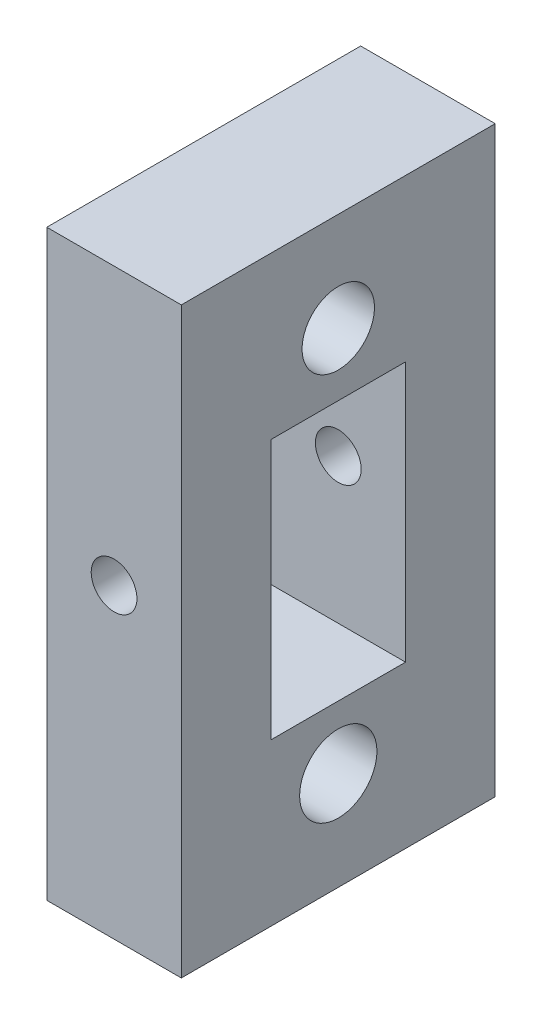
ISO-10303-21;
HEADER;
FILE_DESCRIPTION(('STEP AP214'),'2;1');
FILE_NAME('part.step','',(''),(''),'','','');
FILE_SCHEMA(('AUTOMOTIVE_DESIGN { 1 0 10303 214 1 1 1 1 }'));
ENDSEC;
DATA;
#1=APPLICATION_CONTEXT('core data for automotive mechanical design processes');
#2=APPLICATION_PROTOCOL_DEFINITION('international standard','automotive_design',2000,#1);
#3=PRODUCT_CONTEXT('',#1,'mechanical');
#4=PRODUCT('Part','Part','',(#3));
#5=PRODUCT_RELATED_PRODUCT_CATEGORY('part','',(#4));
#6=PRODUCT_DEFINITION_FORMATION('','',#4);
#7=PRODUCT_DEFINITION_CONTEXT('part definition',#1,'design');
#8=PRODUCT_DEFINITION('design','',#6,#7);
#9=PRODUCT_DEFINITION_SHAPE('','',#8);
#10=(LENGTH_UNIT() NAMED_UNIT(*) SI_UNIT(.MILLI.,.METRE.));
#11=(NAMED_UNIT(*) PLANE_ANGLE_UNIT() SI_UNIT($,.RADIAN.));
#12=(NAMED_UNIT(*) SI_UNIT($,.STERADIAN.) SOLID_ANGLE_UNIT());
#13=UNCERTAINTY_MEASURE_WITH_UNIT(LENGTH_MEASURE(1.E-05),#10,'distance_accuracy_value','');
#14=(GEOMETRIC_REPRESENTATION_CONTEXT(3) GLOBAL_UNCERTAINTY_ASSIGNED_CONTEXT((#13)) GLOBAL_UNIT_ASSIGNED_CONTEXT((#10,
#11,#12)) REPRESENTATION_CONTEXT('',''));
#15=CARTESIAN_POINT('',(0.,0.,0.));
#16=DIRECTION('',(0.,0.,1.));
#17=DIRECTION('',(1.,0.,0.));
#18=AXIS2_PLACEMENT_3D('',#15,#16,#17);
#19=CARTESIAN_POINT('',(0.,0.,0.));
#20=DIRECTION('',(0.,0.,1.));
#21=DIRECTION('',(1.,0.,0.));
#22=AXIS2_PLACEMENT_3D('',#19,#20,#21);
#23=PLANE('',#22);
#24=DIRECTION('',(1.,0.,0.));
#25=VECTOR('',#24,1.);
#26=CARTESIAN_POINT('',(-52.6212681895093,-16.1567681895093,0.));
#27=LINE('',#26,#25);
#28=CARTESIAN_POINT('',(-67.6212681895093,-16.1567681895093,0.));
#29=VERTEX_POINT('',#28);
#30=CARTESIAN_POINT('',(-52.6212681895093,-16.1567681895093,0.));
#31=VERTEX_POINT('',#30);
#32=EDGE_CURVE('E134',#29,#31,#27,.T.);
#33=ORIENTED_EDGE('',*,*,#32,.F.);
#34=DIRECTION('',(0.,-1.,0.));
#35=VECTOR('',#34,1.);
#36=CARTESIAN_POINT('',(-67.6212681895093,30.8432318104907,0.));
#37=LINE('',#36,#35);
#38=CARTESIAN_POINT('',(-67.6212681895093,12.8432318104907,0.));
#39=VERTEX_POINT('',#38);
#40=EDGE_CURVE('E157',#39,#29,#37,.T.);
#41=ORIENTED_EDGE('',*,*,#40,.F.);
#42=DIRECTION('',(-1.,0.,0.));
#43=VECTOR('',#42,1.);
#44=CARTESIAN_POINT('',(-52.6212681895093,12.8432318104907,0.));
#45=LINE('',#44,#43);
#46=CARTESIAN_POINT('',(-52.6212681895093,12.8432318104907,0.));
#47=VERTEX_POINT('',#46);
#48=EDGE_CURVE('E144',#47,#39,#45,.T.);
#49=ORIENTED_EDGE('',*,*,#48,.F.);
#50=DIRECTION('',(0.,1.,0.));
#51=VECTOR('',#50,1.);
#52=CARTESIAN_POINT('',(-52.6212681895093,30.8432318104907,0.));
#53=LINE('',#52,#51);
#54=EDGE_CURVE('E55',#31,#47,#53,.T.);
#55=ORIENTED_EDGE('',*,*,#54,.F.);
#56=EDGE_LOOP('',(#33,#41,#49,#55));
#57=FACE_BOUND('',#56,.T.);
#58=CARTESIAN_POINT('',(-60.1212681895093,0.,0.));
#59=DIRECTION('',(0.,0.,1.));
#60=DIRECTION('',(1.,0.,0.));
#61=AXIS2_PLACEMENT_3D('',#58,#59,#60);
#62=CIRCLE('',#61,2.54999999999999);
#63=CARTESIAN_POINT('',(-57.5712681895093,0.,0.));
#64=VERTEX_POINT('',#63);
#65=EDGE_CURVE('E252',#64,#64,#62,.F.);
#66=ORIENTED_EDGE('',*,*,#65,.F.);
#67=EDGE_LOOP('',(#66));
#68=FACE_BOUND('',#67,.T.);
#69=ADVANCED_FACE('F33',(#57,#68),#23,.F.);
#70=CARTESIAN_POINT('',(0.,0.,10.));
#71=DIRECTION('',(0.,0.,1.));
#72=DIRECTION('',(1.,0.,0.));
#73=AXIS2_PLACEMENT_3D('',#70,#71,#72);
#74=PLANE('',#73);
#75=DIRECTION('',(0.,-1.,0.));
#76=VECTOR('',#75,1.);
#77=CARTESIAN_POINT('',(-67.6212681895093,30.8432318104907,10.));
#78=LINE('',#77,#76);
#79=CARTESIAN_POINT('',(-67.6212681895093,30.8432318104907,10.));
#80=VERTEX_POINT('',#79);
#81=CARTESIAN_POINT('',(-67.6212681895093,-34.1567681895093,10.));
#82=VERTEX_POINT('',#81);
#83=EDGE_CURVE('E151',#80,#82,#78,.T.);
#84=ORIENTED_EDGE('',*,*,#83,.T.);
#85=DIRECTION('',(1.,0.,0.));
#86=VECTOR('',#85,1.);
#87=CARTESIAN_POINT('',(-67.6212681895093,-34.1567681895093,10.));
#88=LINE('',#87,#86);
#89=CARTESIAN_POINT('',(-52.6212681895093,-34.1567681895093,10.));
#90=VERTEX_POINT('',#89);
#91=EDGE_CURVE('E183',#82,#90,#88,.T.);
#92=ORIENTED_EDGE('',*,*,#91,.T.);
#93=DIRECTION('',(0.,1.,0.));
#94=VECTOR('',#93,1.);
#95=CARTESIAN_POINT('',(-52.6212681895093,30.8432318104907,10.));
#96=LINE('',#95,#94);
#97=CARTESIAN_POINT('',(-52.6212681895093,30.8432318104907,10.));
#98=VERTEX_POINT('',#97);
#99=EDGE_CURVE('E105',#90,#98,#96,.T.);
#100=ORIENTED_EDGE('',*,*,#99,.T.);
#101=DIRECTION('',(-1.,0.,0.));
#102=VECTOR('',#101,1.);
#103=CARTESIAN_POINT('',(-67.6212681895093,30.8432318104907,10.));
#104=LINE('',#103,#102);
#105=EDGE_CURVE('E175',#98,#80,#104,.T.);
#106=ORIENTED_EDGE('',*,*,#105,.T.);
#107=EDGE_LOOP('',(#84,#92,#100,#106));
#108=FACE_BOUND('',#107,.T.);
#109=CARTESIAN_POINT('',(-60.1212681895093,0.,10.));
#110=DIRECTION('',(0.,0.,-1.));
#111=DIRECTION('',(-1.,0.,0.));
#112=AXIS2_PLACEMENT_3D('',#109,#110,#111);
#113=CIRCLE('',#112,2.54999999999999);
#114=CARTESIAN_POINT('',(-62.6712681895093,0.,10.));
#115=VERTEX_POINT('',#114);
#116=EDGE_CURVE('E249',#115,#115,#113,.T.);
#117=ORIENTED_EDGE('',*,*,#116,.T.);
#118=EDGE_LOOP('',(#117));
#119=FACE_BOUND('',#118,.T.);
#120=ADVANCED_FACE('F185',(#108,#119),#74,.T.);
#121=CARTESIAN_POINT('',(0.,0.,-15.));
#122=DIRECTION('',(0.,0.,-1.));
#123=DIRECTION('',(-1.,0.,0.));
#124=AXIS2_PLACEMENT_3D('',#121,#122,#123);
#125=PLANE('',#124);
#126=DIRECTION('',(0.,-1.,0.));
#127=VECTOR('',#126,1.);
#128=CARTESIAN_POINT('',(-52.6212681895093,30.8432318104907,-15.));
#129=LINE('',#128,#127);
#130=CARTESIAN_POINT('',(-52.6212681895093,12.8432318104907,-15.));
#131=VERTEX_POINT('',#130);
#132=CARTESIAN_POINT('',(-52.6212681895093,-16.1567681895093,-15.));
#133=VERTEX_POINT('',#132);
#134=EDGE_CURVE('E126',#131,#133,#129,.T.);
#135=ORIENTED_EDGE('',*,*,#134,.F.);
#136=DIRECTION('',(-1.,0.,0.));
#137=VECTOR('',#136,1.);
#138=CARTESIAN_POINT('',(-52.6212681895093,12.8432318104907,-15.));
#139=LINE('',#138,#137);
#140=CARTESIAN_POINT('',(-67.6212681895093,12.8432318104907,-15.));
#141=VERTEX_POINT('',#140);
#142=EDGE_CURVE('E145',#131,#141,#139,.T.);
#143=ORIENTED_EDGE('',*,*,#142,.T.);
#144=DIRECTION('',(0.,1.,0.));
#145=VECTOR('',#144,1.);
#146=CARTESIAN_POINT('',(-67.6212681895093,30.8432318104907,-15.));
#147=LINE('',#146,#145);
#148=CARTESIAN_POINT('',(-67.6212681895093,-16.1567681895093,-15.));
#149=VERTEX_POINT('',#148);
#150=EDGE_CURVE('E123',#149,#141,#147,.T.);
#151=ORIENTED_EDGE('',*,*,#150,.F.);
#152=DIRECTION('',(1.,0.,0.));
#153=VECTOR('',#152,1.);
#154=CARTESIAN_POINT('',(-52.6212681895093,-16.1567681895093,-15.));
#155=LINE('',#154,#153);
#156=EDGE_CURVE('E137',#149,#133,#155,.T.);
#157=ORIENTED_EDGE('',*,*,#156,.T.);
#158=EDGE_LOOP('',(#135,#143,#151,#157));
#159=FACE_BOUND('',#158,.T.);
#160=CARTESIAN_POINT('',(-60.1212681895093,0.,-15.));
#161=DIRECTION('',(0.,0.,-1.));
#162=DIRECTION('',(-1.,0.,0.));
#163=AXIS2_PLACEMENT_3D('',#160,#161,#162);
#164=CIRCLE('',#163,2.54999999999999);
#165=CARTESIAN_POINT('',(-62.6712681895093,0.,-15.));
#166=VERTEX_POINT('',#165);
#167=EDGE_CURVE('E254',#166,#166,#164,.F.);
#168=ORIENTED_EDGE('',*,*,#167,.F.);
#169=EDGE_LOOP('',(#168));
#170=FACE_BOUND('',#169,.T.);
#171=ADVANCED_FACE('F196',(#159,#170),#125,.F.);
#172=CARTESIAN_POINT('',(0.,0.,-25.));
#173=DIRECTION('',(0.,0.,-1.));
#174=DIRECTION('',(-1.,0.,0.));
#175=AXIS2_PLACEMENT_3D('',#172,#173,#174);
#176=PLANE('',#175);
#177=DIRECTION('',(0.,-1.,0.));
#178=VECTOR('',#177,1.);
#179=CARTESIAN_POINT('',(-52.6212681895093,30.8432318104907,-25.));
#180=LINE('',#179,#178);
#181=CARTESIAN_POINT('',(-52.6212681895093,30.8432318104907,-25.));
#182=VERTEX_POINT('',#181);
#183=CARTESIAN_POINT('',(-52.6212681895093,-34.1567681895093,-25.));
#184=VERTEX_POINT('',#183);
#185=EDGE_CURVE('E104',#182,#184,#180,.T.);
#186=ORIENTED_EDGE('',*,*,#185,.T.);
#187=DIRECTION('',(-1.,0.,0.));
#188=VECTOR('',#187,1.);
#189=CARTESIAN_POINT('',(-52.6212681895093,-34.1567681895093,-25.));
#190=LINE('',#189,#188);
#191=CARTESIAN_POINT('',(-67.6212681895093,-34.1567681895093,-25.));
#192=VERTEX_POINT('',#191);
#193=EDGE_CURVE('E110',#184,#192,#190,.T.);
#194=ORIENTED_EDGE('',*,*,#193,.T.);
#195=DIRECTION('',(0.,1.,0.));
#196=VECTOR('',#195,1.);
#197=CARTESIAN_POINT('',(-67.6212681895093,30.8432318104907,-25.));
#198=LINE('',#197,#196);
#199=CARTESIAN_POINT('',(-67.6212681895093,30.8432318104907,-25.));
#200=VERTEX_POINT('',#199);
#201=EDGE_CURVE('E116',#192,#200,#198,.T.);
#202=ORIENTED_EDGE('',*,*,#201,.T.);
#203=DIRECTION('',(1.,0.,0.));
#204=VECTOR('',#203,1.);
#205=CARTESIAN_POINT('',(-52.6212681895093,30.8432318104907,-25.));
#206=LINE('',#205,#204);
#207=EDGE_CURVE('E122',#200,#182,#206,.T.);
#208=ORIENTED_EDGE('',*,*,#207,.T.);
#209=EDGE_LOOP('',(#186,#194,#202,#208));
#210=FACE_BOUND('',#209,.T.);
#211=CARTESIAN_POINT('',(-60.1212681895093,0.,-25.));
#212=DIRECTION('',(0.,0.,-1.));
#213=DIRECTION('',(-1.,0.,0.));
#214=AXIS2_PLACEMENT_3D('',#211,#212,#213);
#215=CIRCLE('',#214,2.54999999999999);
#216=CARTESIAN_POINT('',(-62.6712681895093,0.,-25.));
#217=VERTEX_POINT('',#216);
#218=EDGE_CURVE('E258',#217,#217,#215,.T.);
#219=ORIENTED_EDGE('',*,*,#218,.F.);
#220=EDGE_LOOP('',(#219));
#221=FACE_BOUND('',#220,.T.);
#222=ADVANCED_FACE('F119',(#210,#221),#176,.T.);
#223=CARTESIAN_POINT('',(-67.6212681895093,30.8432318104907,10.));
#224=DIRECTION('',(1.,0.,0.));
#225=DIRECTION('',(0.,0.,-1.));
#226=AXIS2_PLACEMENT_3D('',#223,#224,#225);
#227=PLANE('',#226);
#228=CARTESIAN_POINT('',(-67.6212681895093,-23.1567681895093,-7.5));
#229=DIRECTION('',(-1.,0.,0.));
#230=DIRECTION('',(0.,0.,1.));
#231=AXIS2_PLACEMENT_3D('',#228,#229,#230);
#232=CIRCLE('',#231,4.30861507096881);
#233=CARTESIAN_POINT('',(-67.6212681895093,-23.1567681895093,-3.19138492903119));
#234=VERTEX_POINT('',#233);
#235=EDGE_CURVE('E253',#234,#234,#232,.T.);
#236=ORIENTED_EDGE('',*,*,#235,.F.);
#237=EDGE_LOOP('',(#236));
#238=FACE_BOUND('',#237,.T.);
#239=CARTESIAN_POINT('',(-67.6212681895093,19.8432318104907,-7.5));
#240=DIRECTION('',(-1.,0.,0.));
#241=DIRECTION('',(0.,0.,1.));
#242=AXIS2_PLACEMENT_3D('',#239,#240,#241);
#243=CIRCLE('',#242,4.03728812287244);
#244=CARTESIAN_POINT('',(-67.6212681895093,19.8432318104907,-3.46271187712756));
#245=VERTEX_POINT('',#244);
#246=EDGE_CURVE('E129',#245,#245,#243,.T.);
#247=ORIENTED_EDGE('',*,*,#246,.F.);
#248=EDGE_LOOP('',(#247));
#249=FACE_BOUND('',#248,.T.);
#250=DIRECTION('',(0.,0.,-1.));
#251=VECTOR('',#250,1.);
#252=CARTESIAN_POINT('',(-67.6212681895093,30.8432318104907,10.));
#253=LINE('',#252,#251);
#254=EDGE_CURVE('E173',#80,#200,#253,.T.);
#255=ORIENTED_EDGE('',*,*,#254,.T.);
#256=ORIENTED_EDGE('',*,*,#201,.F.);
#257=DIRECTION('',(0.,0.,-1.));
#258=VECTOR('',#257,1.);
#259=CARTESIAN_POINT('',(-67.6212681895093,-34.1567681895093,10.));
#260=LINE('',#259,#258);
#261=EDGE_CURVE('E11',#82,#192,#260,.T.);
#262=ORIENTED_EDGE('',*,*,#261,.F.);
#263=ORIENTED_EDGE('',*,*,#83,.F.);
#264=EDGE_LOOP('',(#255,#256,#262,#263));
#265=FACE_BOUND('',#264,.T.);
#266=ORIENTED_EDGE('',*,*,#150,.T.);
#267=DIRECTION('',(0.,0.,1.));
#268=VECTOR('',#267,1.);
#269=CARTESIAN_POINT('',(-67.6212681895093,12.8432318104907,-15.));
#270=LINE('',#269,#268);
#271=EDGE_CURVE('E148',#141,#39,#270,.T.);
#272=ORIENTED_EDGE('',*,*,#271,.T.);
#273=ORIENTED_EDGE('',*,*,#40,.T.);
#274=DIRECTION('',(0.,0.,1.));
#275=VECTOR('',#274,1.);
#276=CARTESIAN_POINT('',(-67.6212681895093,-16.1567681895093,-15.));
#277=LINE('',#276,#275);
#278=EDGE_CURVE('E142',#149,#29,#277,.T.);
#279=ORIENTED_EDGE('',*,*,#278,.F.);
#280=EDGE_LOOP('',(#266,#272,#273,#279));
#281=FACE_BOUND('',#280,.T.);
#282=ADVANCED_FACE('F35',(#238,#249,#265,#281),#227,.F.);
#283=CARTESIAN_POINT('',(-67.6212681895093,-34.1567681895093,10.));
#284=DIRECTION('',(0.,1.,0.));
#285=DIRECTION('',(0.,0.,1.));
#286=AXIS2_PLACEMENT_3D('',#283,#284,#285);
#287=PLANE('',#286);
#288=ORIENTED_EDGE('',*,*,#261,.T.);
#289=ORIENTED_EDGE('',*,*,#193,.F.);
#290=DIRECTION('',(0.,0.,-1.));
#291=VECTOR('',#290,1.);
#292=CARTESIAN_POINT('',(-52.6212681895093,-34.1567681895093,10.));
#293=LINE('',#292,#291);
#294=EDGE_CURVE('E42',#90,#184,#293,.T.);
#295=ORIENTED_EDGE('',*,*,#294,.F.);
#296=ORIENTED_EDGE('',*,*,#91,.F.);
#297=EDGE_LOOP('',(#288,#289,#295,#296));
#298=FACE_BOUND('',#297,.T.);
#299=ADVANCED_FACE('F111',(#298),#287,.F.);
#300=CARTESIAN_POINT('',(-52.6212681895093,30.8432318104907,10.));
#301=DIRECTION('',(-1.,0.,0.));
#302=DIRECTION('',(0.,-1.,0.));
#303=AXIS2_PLACEMENT_3D('',#300,#301,#302);
#304=PLANE('',#303);
#305=CARTESIAN_POINT('',(-52.6212681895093,-23.1567681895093,-7.5));
#306=DIRECTION('',(-1.,0.,0.));
#307=DIRECTION('',(0.,-1.,0.));
#308=AXIS2_PLACEMENT_3D('',#305,#306,#307);
#309=CIRCLE('',#308,4.30861507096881);
#310=CARTESIAN_POINT('',(-52.6212681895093,-27.4653832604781,-7.5));
#311=VERTEX_POINT('',#310);
#312=EDGE_CURVE('E37',#311,#311,#309,.T.);
#313=ORIENTED_EDGE('',*,*,#312,.T.);
#314=EDGE_LOOP('',(#313));
#315=FACE_BOUND('',#314,.T.);
#316=CARTESIAN_POINT('',(-52.6212681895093,19.8432318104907,-7.5));
#317=DIRECTION('',(-1.,0.,0.));
#318=DIRECTION('',(0.,-1.,0.));
#319=AXIS2_PLACEMENT_3D('',#316,#317,#318);
#320=CIRCLE('',#319,4.03728812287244);
#321=CARTESIAN_POINT('',(-52.6212681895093,15.8059436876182,-7.5));
#322=VERTEX_POINT('',#321);
#323=EDGE_CURVE('E135',#322,#322,#320,.T.);
#324=ORIENTED_EDGE('',*,*,#323,.T.);
#325=EDGE_LOOP('',(#324));
#326=FACE_BOUND('',#325,.T.);
#327=DIRECTION('',(0.,0.,1.));
#328=VECTOR('',#327,1.);
#329=CARTESIAN_POINT('',(-52.6212681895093,12.8432318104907,-15.));
#330=LINE('',#329,#328);
#331=EDGE_CURVE('E161',#131,#47,#330,.T.);
#332=ORIENTED_EDGE('',*,*,#331,.F.);
#333=ORIENTED_EDGE('',*,*,#134,.T.);
#334=DIRECTION('',(0.,0.,1.));
#335=VECTOR('',#334,1.);
#336=CARTESIAN_POINT('',(-52.6212681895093,-16.1567681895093,-15.));
#337=LINE('',#336,#335);
#338=EDGE_CURVE('E50',#133,#31,#337,.T.);
#339=ORIENTED_EDGE('',*,*,#338,.T.);
#340=ORIENTED_EDGE('',*,*,#54,.T.);
#341=EDGE_LOOP('',(#332,#333,#339,#340));
#342=FACE_BOUND('',#341,.T.);
#343=ORIENTED_EDGE('',*,*,#294,.T.);
#344=ORIENTED_EDGE('',*,*,#185,.F.);
#345=DIRECTION('',(0.,0.,-1.));
#346=VECTOR('',#345,1.);
#347=CARTESIAN_POINT('',(-52.6212681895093,30.8432318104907,10.));
#348=LINE('',#347,#346);
#349=EDGE_CURVE('E107',#98,#182,#348,.T.);
#350=ORIENTED_EDGE('',*,*,#349,.F.);
#351=ORIENTED_EDGE('',*,*,#99,.F.);
#352=EDGE_LOOP('',(#343,#344,#350,#351));
#353=FACE_BOUND('',#352,.T.);
#354=ADVANCED_FACE('F101',(#315,#326,#342,#353),#304,.F.);
#355=CARTESIAN_POINT('',(-67.6212681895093,30.8432318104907,10.));
#356=DIRECTION('',(0.,-1.,0.));
#357=DIRECTION('',(0.,0.,-1.));
#358=AXIS2_PLACEMENT_3D('',#355,#356,#357);
#359=PLANE('',#358);
#360=ORIENTED_EDGE('',*,*,#349,.T.);
#361=ORIENTED_EDGE('',*,*,#207,.F.);
#362=ORIENTED_EDGE('',*,*,#254,.F.);
#363=ORIENTED_EDGE('',*,*,#105,.F.);
#364=EDGE_LOOP('',(#360,#361,#362,#363));
#365=FACE_BOUND('',#364,.T.);
#366=ADVANCED_FACE('F178',(#365),#359,.F.);
#367=CARTESIAN_POINT('',(-52.6212681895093,12.8432318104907,-15.));
#368=DIRECTION('',(0.,1.,0.));
#369=DIRECTION('',(0.,0.,1.));
#370=AXIS2_PLACEMENT_3D('',#367,#368,#369);
#371=PLANE('',#370);
#372=ORIENTED_EDGE('',*,*,#48,.T.);
#373=ORIENTED_EDGE('',*,*,#271,.F.);
#374=ORIENTED_EDGE('',*,*,#142,.F.);
#375=ORIENTED_EDGE('',*,*,#331,.T.);
#376=EDGE_LOOP('',(#372,#373,#374,#375));
#377=FACE_BOUND('',#376,.T.);
#378=ADVANCED_FACE('F199',(#377),#371,.F.);
#379=CARTESIAN_POINT('',(-52.6212681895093,-16.1567681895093,-15.));
#380=DIRECTION('',(0.,-1.,0.));
#381=DIRECTION('',(0.,0.,-1.));
#382=AXIS2_PLACEMENT_3D('',#379,#380,#381);
#383=PLANE('',#382);
#384=ORIENTED_EDGE('',*,*,#32,.T.);
#385=ORIENTED_EDGE('',*,*,#338,.F.);
#386=ORIENTED_EDGE('',*,*,#156,.F.);
#387=ORIENTED_EDGE('',*,*,#278,.T.);
#388=EDGE_LOOP('',(#384,#385,#386,#387));
#389=FACE_BOUND('',#388,.T.);
#390=ADVANCED_FACE('F222',(#389),#383,.F.);
#391=CARTESIAN_POINT('',(-52.6212181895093,19.8432318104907,-7.5));
#392=DIRECTION('',(-1.,0.,0.));
#393=DIRECTION('',(0.,0.,1.));
#394=AXIS2_PLACEMENT_3D('',#391,#392,#393);
#395=CYLINDRICAL_SURFACE('',#394,4.03728812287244);
#396=ORIENTED_EDGE('',*,*,#246,.T.);
#397=EDGE_LOOP('',(#396));
#398=FACE_BOUND('',#397,.T.);
#399=ORIENTED_EDGE('',*,*,#323,.F.);
#400=EDGE_LOOP('',(#399));
#401=FACE_BOUND('',#400,.T.);
#402=ADVANCED_FACE('F225',(#398,#401),#395,.F.);
#403=CARTESIAN_POINT('',(-52.6212181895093,-23.1567681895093,-7.5));
#404=DIRECTION('',(-1.,0.,0.));
#405=DIRECTION('',(0.,0.,1.));
#406=AXIS2_PLACEMENT_3D('',#403,#404,#405);
#407=CYLINDRICAL_SURFACE('',#406,4.30861507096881);
#408=ORIENTED_EDGE('',*,*,#235,.T.);
#409=EDGE_LOOP('',(#408));
#410=FACE_BOUND('',#409,.T.);
#411=ORIENTED_EDGE('',*,*,#312,.F.);
#412=EDGE_LOOP('',(#411));
#413=FACE_BOUND('',#412,.T.);
#414=ADVANCED_FACE('F233',(#410,#413),#407,.F.);
#415=CARTESIAN_POINT('',(-60.1212681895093,0.,-25.));
#416=DIRECTION('',(0.,0.,1.));
#417=DIRECTION('',(1.,0.,0.));
#418=AXIS2_PLACEMENT_3D('',#415,#416,#417);
#419=CYLINDRICAL_SURFACE('',#418,2.54999999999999);
#420=ORIENTED_EDGE('',*,*,#218,.T.);
#421=EDGE_LOOP('',(#420));
#422=FACE_BOUND('',#421,.T.);
#423=ORIENTED_EDGE('',*,*,#167,.T.);
#424=EDGE_LOOP('',(#423));
#425=FACE_BOUND('',#424,.T.);
#426=ADVANCED_FACE('F237',(#422,#425),#419,.F.);
#427=ORIENTED_EDGE('',*,*,#116,.F.);
#428=EDGE_LOOP('',(#427));
#429=FACE_BOUND('',#428,.T.);
#430=ORIENTED_EDGE('',*,*,#65,.T.);
#431=EDGE_LOOP('',(#430));
#432=FACE_BOUND('',#431,.T.);
#433=ADVANCED_FACE('F239',(#429,#432),#419,.F.);
#434=CLOSED_SHELL('',(#69,#120,#171,#222,#282,#299,#354,#366,#378,#390,#402,#414,#426,#433));
#435=MANIFOLD_SOLID_BREP('B2',#434);
#436=ADVANCED_BREP_SHAPE_REPRESENTATION('',(#18,#435),#14);
#437=SHAPE_DEFINITION_REPRESENTATION(#9,#436);
ENDSEC;
END-ISO-10303-21;
